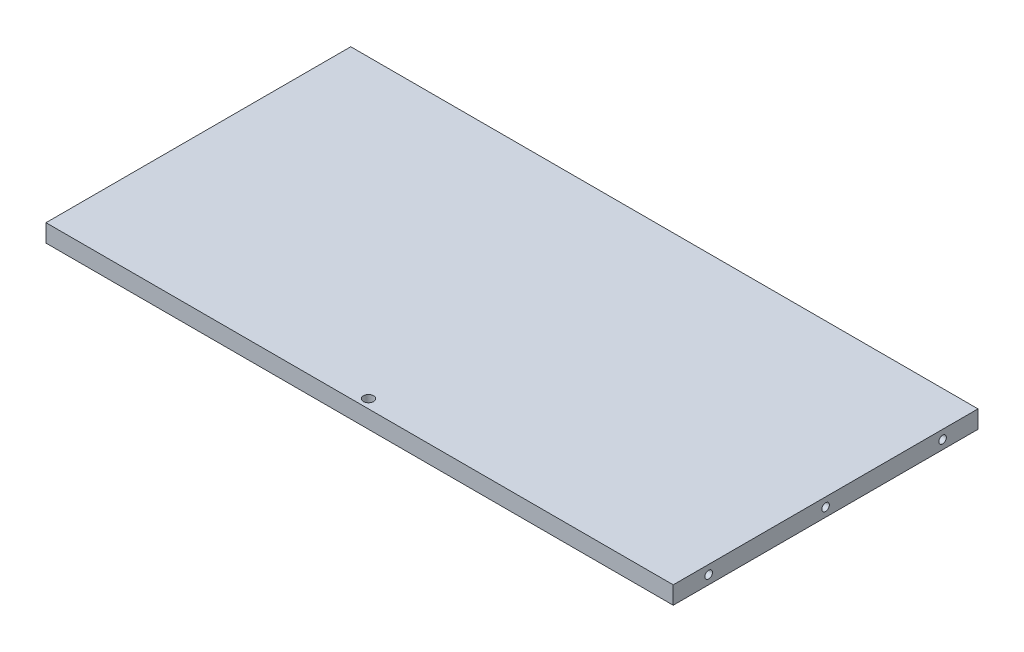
from build123d import *

# Parameters (mm, degrees)
SKETCH1_W                                      = 224.79
SKETCH1_H                                      = 109.22
BOSS_EXTRUDE1_DEPTH                            = 6.35
F_6_32_TAPPED_HOLE1_AT_2_COUNT                 = 2
F_6_32_TAPPED_HOLE1_AT_2_PITCH                 = 41.91
F_6_32_TAPPED_HOLE1_AT_3_COUNT                 = 2
F_6_32_TAPPED_HOLE1_AT_3_PITCH                 = 83.82
CBORE_FOR_6_SOCKET_HEAD_CAP_SCREW1_D           = 3.6576
CBORE_FOR_6_SOCKET_HEAD_CAP_SCREW1_CBORE_D     = 5.715
CBORE_FOR_6_SOCKET_HEAD_CAP_SCREW1_CBORE_DEPTH = 3.5052


with BuildPart() as part:
    # Sketch1 → Boss-Extrude1 (new body)
    with BuildSketch(Plane(origin=(0, 0, 0), x_dir=(1, 0, 0), z_dir=(0, 1, 0))):
        Rectangle(SKETCH1_W, SKETCH1_H)
    extrude(amount=BOSS_EXTRUDE1_DEPTH)

    # Sketch2 → 6-32 Tapped Hole1 (revolve, cut)
    with BuildSketch(Plane(origin=(112.395, 3.175, 41.91), x_dir=(0, 0, -1), z_dir=(0, 1, 0))):
        Polygon((0, 0), (0, 10.21069403), (1.35255, 9.398), (1.35255, 0), align=None)
    f_6_32_tapped_hole1 = revolve(axis=Axis((118.745, 3.175, 41.91), (-1, 0, 0)), mode=Mode.SUBTRACT)

    # 6-32 Tapped Hole1 at 2: 6-32 Tapped Hole1 ×2
    with Locations(*[(0, 0, -i * F_6_32_TAPPED_HOLE1_AT_2_PITCH) for i in range(1, F_6_32_TAPPED_HOLE1_AT_2_COUNT)]):
        add(f_6_32_tapped_hole1, mode=Mode.SUBTRACT)

    # 6-32 Tapped Hole1 at 3: 6-32 Tapped Hole1 ×2
    with Locations(*[(0, 0, -i * F_6_32_TAPPED_HOLE1_AT_3_PITCH) for i in range(1, F_6_32_TAPPED_HOLE1_AT_3_COUNT)]):
        add(f_6_32_tapped_hole1, mode=Mode.SUBTRACT)

    # Mirror1: 6-32 Tapped Hole1 across plane
    add(f_6_32_tapped_hole1.mirror(Plane(origin=(0, 0, 0), x_dir=(0, 0, 1), z_dir=(1, 0, 0))), mode=Mode.SUBTRACT)

    # Mirror1 copy 1 sketch → Mirror1 copy 1 (revolve, cut)
    with BuildSketch(Plane(origin=(-112.395, 3.175, 0), x_dir=(0, 0, -1), z_dir=(0, 1, 0))):
        Polygon((0, 0), (0, -10.21069403), (1.35255, -9.398), (1.35255, 0), align=None)
    revolve(axis=Axis((-118.745, 3.175, 0), (-1, 0, 0)), mode=Mode.SUBTRACT)

    # Mirror1 copy 2 sketch → Mirror1 copy 2 (revolve, cut)
    with BuildSketch(Plane(origin=(-112.395, 3.175, -41.91), x_dir=(0, 0, -1), z_dir=(0, 1, 0))):
        Polygon((0, 0), (0, -10.21069403), (1.35255, -9.398), (1.35255, 0), align=None)
    revolve(axis=Axis((-118.745, 3.175, -41.91), (-1, 0, 0)), mode=Mode.SUBTRACT)

    # CBORE for _6 Socket Head Cap Screw1 (through all)
    with Locations(Plane(origin=(0, 0, 0), x_dir=(-1, 0, 0), z_dir=(0, -1, 0))):
        with Locations((0, -51.435)):
            CounterBoreHole(CBORE_FOR_6_SOCKET_HEAD_CAP_SCREW1_D / 2, CBORE_FOR_6_SOCKET_HEAD_CAP_SCREW1_CBORE_D / 2, CBORE_FOR_6_SOCKET_HEAD_CAP_SCREW1_CBORE_DEPTH)


solid = part.part
